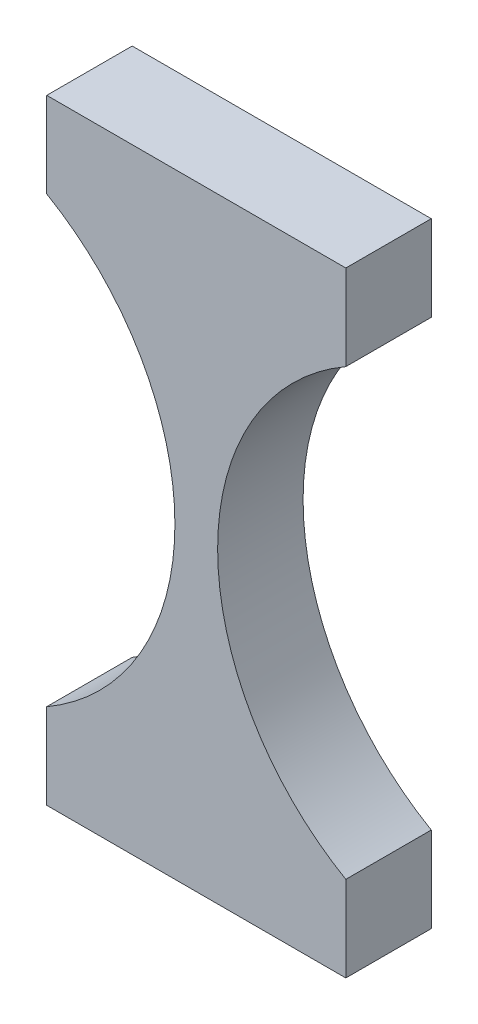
from build123d import *

# Parameters (mm, degrees)
BOSS_EXTRUDE1_DEPTH = 1


with BuildPart() as part:
    # Sketch1 → Boss-Extrude1 (new body)
    with BuildSketch(Plane.XY):
        with BuildLine():
            Line((-1.75, 3.598076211), (1.75, 3.598076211))
            Line((1.75, 3.598076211), (1.75, 2.598076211))
            ThreePointArc((1.75, 2.598076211), (0.25, 0), (1.75, -2.598076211))
            Line((1.75, -2.598076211), (1.75, -3.598076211))
            Line((1.75, -3.598076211), (-1.75, -3.598076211))
            Line((-1.75, -3.598076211), (-1.75, -2.598076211))
            ThreePointArc((-1.75, -2.598076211), (-0.25, 0), (-1.75, 2.598076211))
            Line((-1.75, 2.598076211), (-1.75, 3.598076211))
        make_face()
    extrude(amount=BOSS_EXTRUDE1_DEPTH)


solid = part.part
